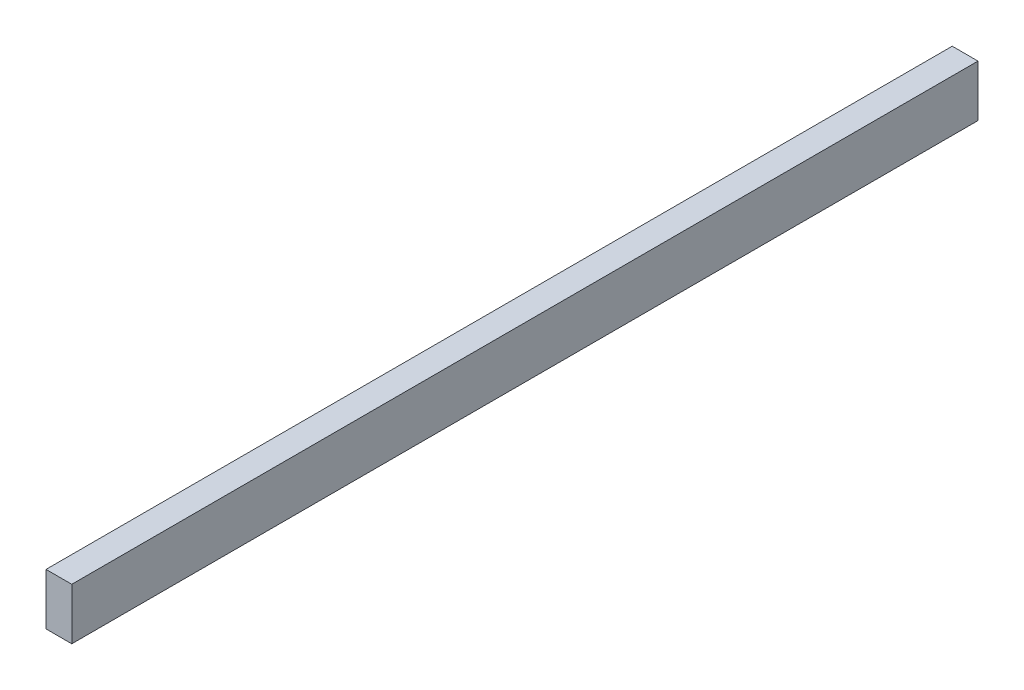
ISO-10303-21;
HEADER;
FILE_DESCRIPTION(('STEP AP214'),'2;1');
FILE_NAME('part.step','',(''),(''),'','','');
FILE_SCHEMA(('AUTOMOTIVE_DESIGN { 1 0 10303 214 1 1 1 1 }'));
ENDSEC;
DATA;
#1=APPLICATION_CONTEXT('core data for automotive mechanical design processes');
#2=APPLICATION_PROTOCOL_DEFINITION('international standard','automotive_design',2000,#1);
#3=PRODUCT_CONTEXT('',#1,'mechanical');
#4=PRODUCT('Part','Part','',(#3));
#5=PRODUCT_RELATED_PRODUCT_CATEGORY('part','',(#4));
#6=PRODUCT_DEFINITION_FORMATION('','',#4);
#7=PRODUCT_DEFINITION_CONTEXT('part definition',#1,'design');
#8=PRODUCT_DEFINITION('design','',#6,#7);
#9=PRODUCT_DEFINITION_SHAPE('','',#8);
#10=(LENGTH_UNIT() NAMED_UNIT(*) SI_UNIT(.MILLI.,.METRE.));
#11=(NAMED_UNIT(*) PLANE_ANGLE_UNIT() SI_UNIT($,.RADIAN.));
#12=(NAMED_UNIT(*) SI_UNIT($,.STERADIAN.) SOLID_ANGLE_UNIT());
#13=UNCERTAINTY_MEASURE_WITH_UNIT(LENGTH_MEASURE(1.E-05),#10,'distance_accuracy_value','');
#14=(GEOMETRIC_REPRESENTATION_CONTEXT(3) GLOBAL_UNCERTAINTY_ASSIGNED_CONTEXT((#13)) GLOBAL_UNIT_ASSIGNED_CONTEXT((#10,
#11,#12)) REPRESENTATION_CONTEXT('',''));
#15=CARTESIAN_POINT('',(0.,0.,0.));
#16=DIRECTION('',(0.,0.,1.));
#17=DIRECTION('',(1.,0.,0.));
#18=AXIS2_PLACEMENT_3D('',#15,#16,#17);
#19=CARTESIAN_POINT('',(0.,0.,175.77));
#20=DIRECTION('',(1.,0.,0.));
#21=DIRECTION('',(0.,0.,-1.));
#22=AXIS2_PLACEMENT_3D('',#19,#20,#21);
#23=PLANE('',#22);
#24=DIRECTION('',(0.,-1.,0.));
#25=VECTOR('',#24,1.);
#26=CARTESIAN_POINT('',(0.,0.,0.));
#27=LINE('',#26,#25);
#28=CARTESIAN_POINT('',(0.,10.,0.));
#29=VERTEX_POINT('',#28);
#30=CARTESIAN_POINT('',(0.,0.,0.));
#31=VERTEX_POINT('',#30);
#32=EDGE_CURVE('E70',#29,#31,#27,.T.);
#33=ORIENTED_EDGE('',*,*,#32,.T.);
#34=DIRECTION('',(0.,0.,-1.));
#35=VECTOR('',#34,1.);
#36=CARTESIAN_POINT('',(0.,0.,175.77));
#37=LINE('',#36,#35);
#38=CARTESIAN_POINT('',(0.,0.,175.77));
#39=VERTEX_POINT('',#38);
#40=EDGE_CURVE('E11',#39,#31,#37,.T.);
#41=ORIENTED_EDGE('',*,*,#40,.F.);
#42=DIRECTION('',(0.,-1.,0.));
#43=VECTOR('',#42,1.);
#44=CARTESIAN_POINT('',(0.,0.,175.77));
#45=LINE('',#44,#43);
#46=CARTESIAN_POINT('',(0.,10.,175.77));
#47=VERTEX_POINT('',#46);
#48=EDGE_CURVE('E88',#47,#39,#45,.T.);
#49=ORIENTED_EDGE('',*,*,#48,.F.);
#50=DIRECTION('',(0.,0.,-1.));
#51=VECTOR('',#50,1.);
#52=CARTESIAN_POINT('',(0.,10.,175.77));
#53=LINE('',#52,#51);
#54=EDGE_CURVE('E82',#47,#29,#53,.T.);
#55=ORIENTED_EDGE('',*,*,#54,.T.);
#56=EDGE_LOOP('',(#33,#41,#49,#55));
#57=FACE_BOUND('',#56,.T.);
#58=ADVANCED_FACE('F26',(#57),#23,.F.);
#59=CARTESIAN_POINT('',(0.,0.,175.77));
#60=DIRECTION('',(0.,1.,0.));
#61=DIRECTION('',(0.,0.,1.));
#62=AXIS2_PLACEMENT_3D('',#59,#60,#61);
#63=PLANE('',#62);
#64=DIRECTION('',(1.,0.,0.));
#65=VECTOR('',#64,1.);
#66=CARTESIAN_POINT('',(0.,0.,0.));
#67=LINE('',#66,#65);
#68=CARTESIAN_POINT('',(5.,0.,0.));
#69=VERTEX_POINT('',#68);
#70=EDGE_CURVE('E66',#31,#69,#67,.T.);
#71=ORIENTED_EDGE('',*,*,#70,.T.);
#72=DIRECTION('',(0.,0.,-1.));
#73=VECTOR('',#72,1.);
#74=CARTESIAN_POINT('',(5.,0.,175.77));
#75=LINE('',#74,#73);
#76=CARTESIAN_POINT('',(5.,0.,175.77));
#77=VERTEX_POINT('',#76);
#78=EDGE_CURVE('E33',#77,#69,#75,.T.);
#79=ORIENTED_EDGE('',*,*,#78,.F.);
#80=DIRECTION('',(1.,0.,0.));
#81=VECTOR('',#80,1.);
#82=CARTESIAN_POINT('',(0.,0.,175.77));
#83=LINE('',#82,#81);
#84=EDGE_CURVE('E78',#39,#77,#83,.T.);
#85=ORIENTED_EDGE('',*,*,#84,.F.);
#86=ORIENTED_EDGE('',*,*,#40,.T.);
#87=EDGE_LOOP('',(#71,#79,#85,#86));
#88=FACE_BOUND('',#87,.T.);
#89=ADVANCED_FACE('F77',(#88),#63,.F.);
#90=CARTESIAN_POINT('',(5.,0.,175.77));
#91=DIRECTION('',(-1.,0.,0.));
#92=DIRECTION('',(0.,0.,1.));
#93=AXIS2_PLACEMENT_3D('',#90,#91,#92);
#94=PLANE('',#93);
#95=DIRECTION('',(0.,1.,0.));
#96=VECTOR('',#95,1.);
#97=CARTESIAN_POINT('',(5.,0.,0.));
#98=LINE('',#97,#96);
#99=CARTESIAN_POINT('',(5.,10.,0.));
#100=VERTEX_POINT('',#99);
#101=EDGE_CURVE('E71',#69,#100,#98,.T.);
#102=ORIENTED_EDGE('',*,*,#101,.T.);
#103=DIRECTION('',(0.,0.,-1.));
#104=VECTOR('',#103,1.);
#105=CARTESIAN_POINT('',(5.,10.,175.77));
#106=LINE('',#105,#104);
#107=CARTESIAN_POINT('',(5.,10.,175.77));
#108=VERTEX_POINT('',#107);
#109=EDGE_CURVE('E94',#108,#100,#106,.T.);
#110=ORIENTED_EDGE('',*,*,#109,.F.);
#111=DIRECTION('',(0.,1.,0.));
#112=VECTOR('',#111,1.);
#113=CARTESIAN_POINT('',(5.,0.,175.77));
#114=LINE('',#113,#112);
#115=EDGE_CURVE('E45',#77,#108,#114,.T.);
#116=ORIENTED_EDGE('',*,*,#115,.F.);
#117=ORIENTED_EDGE('',*,*,#78,.T.);
#118=EDGE_LOOP('',(#102,#110,#116,#117));
#119=FACE_BOUND('',#118,.T.);
#120=ADVANCED_FACE('F97',(#119),#94,.F.);
#121=CARTESIAN_POINT('',(0.,10.,175.77));
#122=DIRECTION('',(0.,-1.,0.));
#123=DIRECTION('',(0.,0.,-1.));
#124=AXIS2_PLACEMENT_3D('',#121,#122,#123);
#125=PLANE('',#124);
#126=DIRECTION('',(-1.,0.,0.));
#127=VECTOR('',#126,1.);
#128=CARTESIAN_POINT('',(0.,10.,0.));
#129=LINE('',#128,#127);
#130=EDGE_CURVE('E86',#100,#29,#129,.T.);
#131=ORIENTED_EDGE('',*,*,#130,.T.);
#132=ORIENTED_EDGE('',*,*,#54,.F.);
#133=DIRECTION('',(-1.,0.,0.));
#134=VECTOR('',#133,1.);
#135=CARTESIAN_POINT('',(0.,10.,175.77));
#136=LINE('',#135,#134);
#137=EDGE_CURVE('E40',#108,#47,#136,.T.);
#138=ORIENTED_EDGE('',*,*,#137,.F.);
#139=ORIENTED_EDGE('',*,*,#109,.T.);
#140=EDGE_LOOP('',(#131,#132,#138,#139));
#141=FACE_BOUND('',#140,.T.);
#142=ADVANCED_FACE('F99',(#141),#125,.F.);
#143=CARTESIAN_POINT('',(0.,10.,175.77));
#144=DIRECTION('',(0.,0.,-1.));
#145=DIRECTION('',(-1.,0.,0.));
#146=AXIS2_PLACEMENT_3D('',#143,#144,#145);
#147=PLANE('',#146);
#148=ORIENTED_EDGE('',*,*,#48,.T.);
#149=ORIENTED_EDGE('',*,*,#84,.T.);
#150=ORIENTED_EDGE('',*,*,#115,.T.);
#151=ORIENTED_EDGE('',*,*,#137,.T.);
#152=EDGE_LOOP('',(#148,#149,#150,#151));
#153=FACE_BOUND('',#152,.T.);
#154=ADVANCED_FACE('F100',(#153),#147,.F.);
#155=CARTESIAN_POINT('',(0.,10.,0.));
#156=DIRECTION('',(0.,0.,-1.));
#157=DIRECTION('',(-1.,0.,0.));
#158=AXIS2_PLACEMENT_3D('',#155,#156,#157);
#159=PLANE('',#158);
#160=ORIENTED_EDGE('',*,*,#32,.F.);
#161=ORIENTED_EDGE('',*,*,#130,.F.);
#162=ORIENTED_EDGE('',*,*,#101,.F.);
#163=ORIENTED_EDGE('',*,*,#70,.F.);
#164=EDGE_LOOP('',(#160,#161,#162,#163));
#165=FACE_BOUND('',#164,.T.);
#166=ADVANCED_FACE('F67',(#165),#159,.T.);
#167=CLOSED_SHELL('',(#58,#89,#120,#142,#154,#166));
#168=MANIFOLD_SOLID_BREP('B2',#167);
#169=ADVANCED_BREP_SHAPE_REPRESENTATION('',(#18,#168),#14);
#170=SHAPE_DEFINITION_REPRESENTATION(#9,#169);
ENDSEC;
END-ISO-10303-21;
